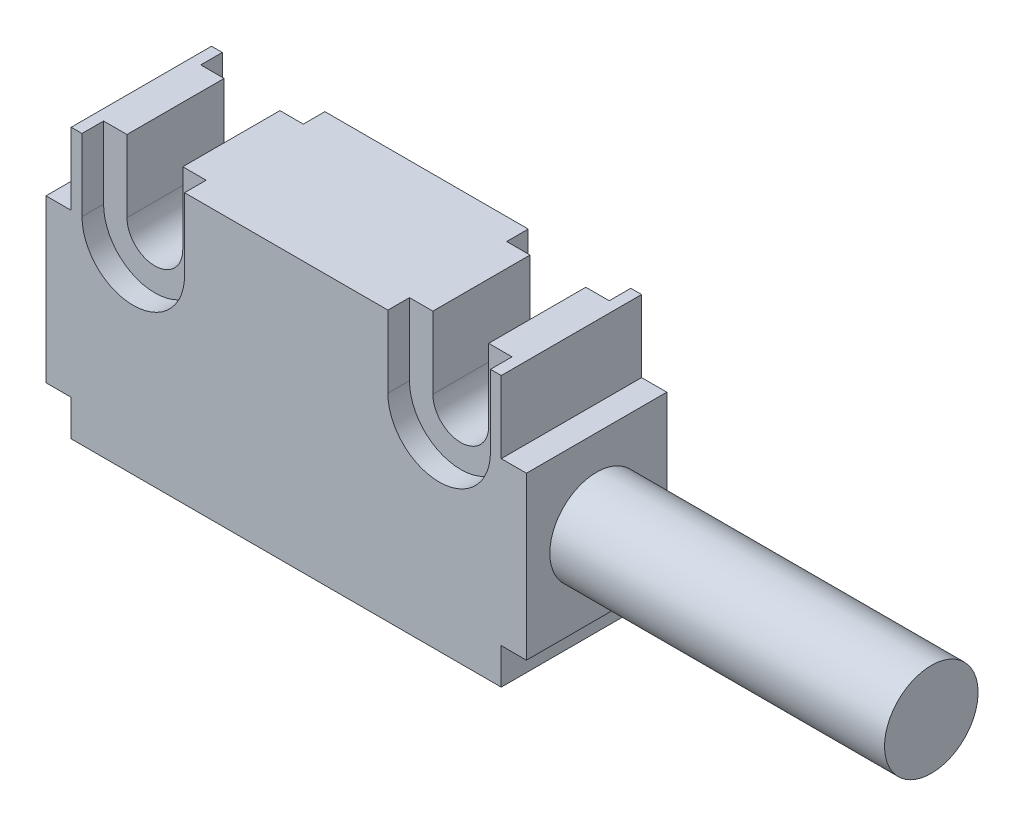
ISO-10303-21;
HEADER;
FILE_DESCRIPTION(('STEP AP214'),'2;1');
FILE_NAME('part.step','',(''),(''),'','','');
FILE_SCHEMA(('AUTOMOTIVE_DESIGN { 1 0 10303 214 1 1 1 1 }'));
ENDSEC;
DATA;
#1=APPLICATION_CONTEXT('core data for automotive mechanical design processes');
#2=APPLICATION_PROTOCOL_DEFINITION('international standard','automotive_design',2000,#1);
#3=PRODUCT_CONTEXT('',#1,'mechanical');
#4=PRODUCT('Part','Part','',(#3));
#5=PRODUCT_RELATED_PRODUCT_CATEGORY('part','',(#4));
#6=PRODUCT_DEFINITION_FORMATION('','',#4);
#7=PRODUCT_DEFINITION_CONTEXT('part definition',#1,'design');
#8=PRODUCT_DEFINITION('design','',#6,#7);
#9=PRODUCT_DEFINITION_SHAPE('','',#8);
#10=(LENGTH_UNIT() NAMED_UNIT(*) SI_UNIT(.MILLI.,.METRE.));
#11=(NAMED_UNIT(*) PLANE_ANGLE_UNIT() SI_UNIT($,.RADIAN.));
#12=(NAMED_UNIT(*) SI_UNIT($,.STERADIAN.) SOLID_ANGLE_UNIT());
#13=UNCERTAINTY_MEASURE_WITH_UNIT(LENGTH_MEASURE(1.E-05),#10,'distance_accuracy_value','');
#14=(GEOMETRIC_REPRESENTATION_CONTEXT(3) GLOBAL_UNCERTAINTY_ASSIGNED_CONTEXT((#13)) GLOBAL_UNIT_ASSIGNED_CONTEXT((#10,
#11,#12)) REPRESENTATION_CONTEXT('',''));
#15=CARTESIAN_POINT('',(0.,0.,0.));
#16=DIRECTION('',(0.,0.,1.));
#17=DIRECTION('',(1.,0.,0.));
#18=AXIS2_PLACEMENT_3D('',#15,#16,#17);
#19=CARTESIAN_POINT('',(8.5,4.5,2.7));
#20=DIRECTION('',(0.,0.,-1.));
#21=DIRECTION('',(-1.,0.,0.));
#22=AXIS2_PLACEMENT_3D('',#19,#20,#21);
#23=PLANE('',#22);
#24=DIRECTION('',(0.,1.,0.));
#25=VECTOR('',#24,1.);
#26=CARTESIAN_POINT('',(11.35,4.5,2.7));
#27=LINE('',#26,#25);
#28=CARTESIAN_POINT('',(11.35,4.5,2.7));
#29=VERTEX_POINT('',#28);
#30=CARTESIAN_POINT('',(11.35,8.5,2.7));
#31=VERTEX_POINT('',#30);
#32=EDGE_CURVE('E279',#29,#31,#27,.T.);
#33=ORIENTED_EDGE('',*,*,#32,.T.);
#34=DIRECTION('',(-1.,0.,0.));
#35=VECTOR('',#34,1.);
#36=CARTESIAN_POINT('',(8.5,8.5,2.7));
#37=LINE('',#36,#35);
#38=CARTESIAN_POINT('',(10.05,8.5,2.7));
#39=VERTEX_POINT('',#38);
#40=EDGE_CURVE('E364',#39,#31,#37,.F.);
#41=ORIENTED_EDGE('',*,*,#40,.F.);
#42=DIRECTION('',(0.,1.,0.));
#43=VECTOR('',#42,1.);
#44=CARTESIAN_POINT('',(10.05,8.5,2.7));
#45=LINE('',#44,#43);
#46=CARTESIAN_POINT('',(10.05,4.5,2.7));
#47=VERTEX_POINT('',#46);
#48=EDGE_CURVE('E248',#39,#47,#45,.F.);
#49=ORIENTED_EDGE('',*,*,#48,.T.);
#50=CARTESIAN_POINT('',(8.5,4.5,2.7));
#51=DIRECTION('',(0.,0.,-1.));
#52=DIRECTION('',(-1.,0.,0.));
#53=AXIS2_PLACEMENT_3D('',#50,#51,#52);
#54=CIRCLE('',#53,1.55);
#55=CARTESIAN_POINT('',(6.95,4.5,2.7));
#56=VERTEX_POINT('',#55);
#57=EDGE_CURVE('E228',#47,#56,#54,.T.);
#58=ORIENTED_EDGE('',*,*,#57,.T.);
#59=DIRECTION('',(0.,-1.,0.));
#60=VECTOR('',#59,1.);
#61=CARTESIAN_POINT('',(6.95,8.5,2.7));
#62=LINE('',#61,#60);
#63=CARTESIAN_POINT('',(6.95,8.5,2.7));
#64=VERTEX_POINT('',#63);
#65=EDGE_CURVE('E208',#56,#64,#62,.F.);
#66=ORIENTED_EDGE('',*,*,#65,.T.);
#67=DIRECTION('',(-1.,0.,0.));
#68=VECTOR('',#67,1.);
#69=CARTESIAN_POINT('',(8.5,8.5,2.7));
#70=LINE('',#69,#68);
#71=CARTESIAN_POINT('',(5.65,8.5,2.7));
#72=VERTEX_POINT('',#71);
#73=EDGE_CURVE('E372',#72,#64,#70,.F.);
#74=ORIENTED_EDGE('',*,*,#73,.F.);
#75=DIRECTION('',(0.,1.,0.));
#76=VECTOR('',#75,1.);
#77=CARTESIAN_POINT('',(5.65,8.5,2.7));
#78=LINE('',#77,#76);
#79=CARTESIAN_POINT('',(5.65,4.5,2.7));
#80=VERTEX_POINT('',#79);
#81=EDGE_CURVE('E329',#72,#80,#78,.F.);
#82=ORIENTED_EDGE('',*,*,#81,.T.);
#83=CARTESIAN_POINT('',(8.5,4.5,2.7));
#84=DIRECTION('',(0.,0.,1.));
#85=DIRECTION('',(1.,0.,0.));
#86=AXIS2_PLACEMENT_3D('',#83,#84,#85);
#87=CIRCLE('',#86,2.85);
#88=EDGE_CURVE('E271',#80,#29,#87,.T.);
#89=ORIENTED_EDGE('',*,*,#88,.T.);
#90=EDGE_LOOP('',(#33,#41,#49,#58,#66,#74,#82,#89));
#91=FACE_BOUND('',#90,.T.);
#92=ADVANCED_FACE('F15',(#91),#23,.F.);
#93=CARTESIAN_POINT('',(-8.5,4.5,2.7));
#94=DIRECTION('',(0.,0.,1.));
#95=DIRECTION('',(1.,0.,0.));
#96=AXIS2_PLACEMENT_3D('',#93,#94,#95);
#97=PLANE('',#96);
#98=CARTESIAN_POINT('',(-8.5,4.5,2.7));
#99=DIRECTION('',(0.,0.,1.));
#100=DIRECTION('',(1.,0.,0.));
#101=AXIS2_PLACEMENT_3D('',#98,#99,#100);
#102=CIRCLE('',#101,2.85);
#103=CARTESIAN_POINT('',(-11.35,4.5,2.7));
#104=VERTEX_POINT('',#103);
#105=CARTESIAN_POINT('',(-5.65,4.5,2.7));
#106=VERTEX_POINT('',#105);
#107=EDGE_CURVE('E312',#104,#106,#102,.T.);
#108=ORIENTED_EDGE('',*,*,#107,.T.);
#109=DIRECTION('',(0.,1.,0.));
#110=VECTOR('',#109,1.);
#111=CARTESIAN_POINT('',(-5.65,8.5,2.7));
#112=LINE('',#111,#110);
#113=CARTESIAN_POINT('',(-5.65,8.5,2.7));
#114=VERTEX_POINT('',#113);
#115=EDGE_CURVE('E316',#106,#114,#112,.T.);
#116=ORIENTED_EDGE('',*,*,#115,.T.);
#117=DIRECTION('',(1.,0.,0.));
#118=VECTOR('',#117,1.);
#119=CARTESIAN_POINT('',(-8.5,8.5,2.7));
#120=LINE('',#119,#118);
#121=CARTESIAN_POINT('',(-6.95,8.5,2.7));
#122=VERTEX_POINT('',#121);
#123=EDGE_CURVE('E201',#114,#122,#120,.F.);
#124=ORIENTED_EDGE('',*,*,#123,.T.);
#125=DIRECTION('',(0.,1.,0.));
#126=VECTOR('',#125,1.);
#127=CARTESIAN_POINT('',(-6.95,8.5,2.7));
#128=LINE('',#127,#126);
#129=CARTESIAN_POINT('',(-6.95,4.5,2.7));
#130=VERTEX_POINT('',#129);
#131=EDGE_CURVE('E192',#122,#130,#128,.F.);
#132=ORIENTED_EDGE('',*,*,#131,.T.);
#133=CARTESIAN_POINT('',(-8.5,4.5,2.7));
#134=DIRECTION('',(0.,0.,-1.));
#135=DIRECTION('',(-1.,0.,0.));
#136=AXIS2_PLACEMENT_3D('',#133,#134,#135);
#137=CIRCLE('',#136,1.55);
#138=CARTESIAN_POINT('',(-10.05,4.5,2.7));
#139=VERTEX_POINT('',#138);
#140=EDGE_CURVE('E18',#130,#139,#137,.T.);
#141=ORIENTED_EDGE('',*,*,#140,.T.);
#142=DIRECTION('',(0.,-1.,0.));
#143=VECTOR('',#142,1.);
#144=CARTESIAN_POINT('',(-10.05,8.5,2.7));
#145=LINE('',#144,#143);
#146=CARTESIAN_POINT('',(-10.05,8.5,2.7));
#147=VERTEX_POINT('',#146);
#148=EDGE_CURVE('E330',#139,#147,#145,.F.);
#149=ORIENTED_EDGE('',*,*,#148,.T.);
#150=DIRECTION('',(1.,0.,0.));
#151=VECTOR('',#150,1.);
#152=CARTESIAN_POINT('',(-8.5,8.5,2.7));
#153=LINE('',#152,#151);
#154=CARTESIAN_POINT('',(-11.35,8.5,2.7));
#155=VERTEX_POINT('',#154);
#156=EDGE_CURVE('E187',#147,#155,#153,.F.);
#157=ORIENTED_EDGE('',*,*,#156,.T.);
#158=DIRECTION('',(0.,-1.,0.));
#159=VECTOR('',#158,1.);
#160=CARTESIAN_POINT('',(-11.35,4.5,2.7));
#161=LINE('',#160,#159);
#162=EDGE_CURVE('E291',#155,#104,#161,.T.);
#163=ORIENTED_EDGE('',*,*,#162,.T.);
#164=EDGE_LOOP('',(#108,#116,#124,#132,#141,#149,#157,#163));
#165=FACE_BOUND('',#164,.T.);
#166=ADVANCED_FACE('F199',(#165),#97,.T.);
#167=CARTESIAN_POINT('',(-8.5,4.5,3.9));
#168=DIRECTION('',(0.,0.,-1.));
#169=DIRECTION('',(-1.,0.,0.));
#170=AXIS2_PLACEMENT_3D('',#167,#168,#169);
#171=CYLINDRICAL_SURFACE('',#170,1.55);
#172=DIRECTION('',(0.,0.,1.));
#173=VECTOR('',#172,1.);
#174=CARTESIAN_POINT('',(-10.05,4.5,3.9));
#175=LINE('',#174,#173);
#176=CARTESIAN_POINT('',(-10.05,4.5,-2.7));
#177=VERTEX_POINT('',#176);
#178=EDGE_CURVE('E181',#177,#139,#175,.T.);
#179=ORIENTED_EDGE('',*,*,#178,.T.);
#180=ORIENTED_EDGE('',*,*,#140,.F.);
#181=DIRECTION('',(0.,0.,1.));
#182=VECTOR('',#181,1.);
#183=CARTESIAN_POINT('',(-6.95,4.5,3.9));
#184=LINE('',#183,#182);
#185=CARTESIAN_POINT('',(-6.95,4.5,-2.7));
#186=VERTEX_POINT('',#185);
#187=EDGE_CURVE('E179',#130,#186,#184,.F.);
#188=ORIENTED_EDGE('',*,*,#187,.T.);
#189=CARTESIAN_POINT('',(-8.5,4.5,-2.7));
#190=DIRECTION('',(0.,0.,-1.));
#191=DIRECTION('',(-1.,0.,0.));
#192=AXIS2_PLACEMENT_3D('',#189,#190,#191);
#193=CIRCLE('',#192,1.55);
#194=EDGE_CURVE('E450',#177,#186,#193,.F.);
#195=ORIENTED_EDGE('',*,*,#194,.F.);
#196=EDGE_LOOP('',(#179,#180,#188,#195));
#197=FACE_BOUND('',#196,.T.);
#198=ADVANCED_FACE('F177',(#197),#171,.F.);
#199=CARTESIAN_POINT('',(-10.05,8.5,3.9));
#200=DIRECTION('',(-1.,0.,0.));
#201=DIRECTION('',(0.,-1.,0.));
#202=AXIS2_PLACEMENT_3D('',#199,#200,#201);
#203=PLANE('',#202);
#204=DIRECTION('',(0.,0.,1.));
#205=VECTOR('',#204,1.);
#206=CARTESIAN_POINT('',(-10.05,8.5,3.9));
#207=LINE('',#206,#205);
#208=CARTESIAN_POINT('',(-10.05,8.5,-2.7));
#209=VERTEX_POINT('',#208);
#210=EDGE_CURVE('E297',#209,#147,#207,.T.);
#211=ORIENTED_EDGE('',*,*,#210,.T.);
#212=ORIENTED_EDGE('',*,*,#148,.F.);
#213=ORIENTED_EDGE('',*,*,#178,.F.);
#214=DIRECTION('',(0.,1.,0.));
#215=VECTOR('',#214,1.);
#216=CARTESIAN_POINT('',(-10.05,4.5,-2.7));
#217=LINE('',#216,#215);
#218=EDGE_CURVE('E196',#209,#177,#217,.F.);
#219=ORIENTED_EDGE('',*,*,#218,.F.);
#220=EDGE_LOOP('',(#211,#212,#213,#219));
#221=FACE_BOUND('',#220,.T.);
#222=ADVANCED_FACE('F1040',(#221),#203,.F.);
#223=CARTESIAN_POINT('',(31.95,0.,0.));
#224=DIRECTION('',(1.,0.,0.));
#225=DIRECTION('',(0.,0.,-1.));
#226=AXIS2_PLACEMENT_3D('',#223,#224,#225);
#227=PLANE('',#226);
#228=CARTESIAN_POINT('',(31.95,0.,0.));
#229=DIRECTION('',(-1.,0.,0.));
#230=DIRECTION('',(0.,0.,1.));
#231=AXIS2_PLACEMENT_3D('',#228,#229,#230);
#232=CIRCLE('',#231,2.6);
#233=CARTESIAN_POINT('',(31.95,0.,2.6));
#234=VERTEX_POINT('',#233);
#235=EDGE_CURVE('E444',#234,#234,#232,.T.);
#236=ORIENTED_EDGE('',*,*,#235,.F.);
#237=EDGE_LOOP('',(#236));
#238=FACE_BOUND('',#237,.T.);
#239=ADVANCED_FACE('F718',(#238),#227,.T.);
#240=CARTESIAN_POINT('',(5.65,8.5,2.7));
#241=DIRECTION('',(-1.,0.,0.));
#242=DIRECTION('',(0.,0.,1.));
#243=AXIS2_PLACEMENT_3D('',#240,#241,#242);
#244=PLANE('',#243);
#245=DIRECTION('',(0.,0.,1.));
#246=VECTOR('',#245,1.);
#247=CARTESIAN_POINT('',(5.65,4.5,2.7));
#248=LINE('',#247,#246);
#249=CARTESIAN_POINT('',(5.65,4.5,3.9));
#250=VERTEX_POINT('',#249);
#251=EDGE_CURVE('E272',#250,#80,#248,.F.);
#252=ORIENTED_EDGE('',*,*,#251,.T.);
#253=ORIENTED_EDGE('',*,*,#81,.F.);
#254=DIRECTION('',(0.,0.,1.));
#255=VECTOR('',#254,1.);
#256=CARTESIAN_POINT('',(5.65,8.5,2.7));
#257=LINE('',#256,#255);
#258=CARTESIAN_POINT('',(5.65,8.5,3.9));
#259=VERTEX_POINT('',#258);
#260=EDGE_CURVE('E325',#259,#72,#257,.F.);
#261=ORIENTED_EDGE('',*,*,#260,.F.);
#262=DIRECTION('',(0.,1.,0.));
#263=VECTOR('',#262,1.);
#264=CARTESIAN_POINT('',(5.65,4.5,3.9));
#265=LINE('',#264,#263);
#266=EDGE_CURVE('E480',#250,#259,#265,.T.);
#267=ORIENTED_EDGE('',*,*,#266,.F.);
#268=EDGE_LOOP('',(#252,#253,#261,#267));
#269=FACE_BOUND('',#268,.T.);
#270=ADVANCED_FACE('F704',(#269),#244,.F.);
#271=CARTESIAN_POINT('',(-5.65,8.5,2.7));
#272=DIRECTION('',(1.,0.,0.));
#273=DIRECTION('',(0.,0.,-1.));
#274=AXIS2_PLACEMENT_3D('',#271,#272,#273);
#275=PLANE('',#274);
#276=DIRECTION('',(0.,0.,-1.));
#277=VECTOR('',#276,1.);
#278=CARTESIAN_POINT('',(-5.65,8.5,2.7));
#279=LINE('',#278,#277);
#280=CARTESIAN_POINT('',(-5.65,8.5,3.9));
#281=VERTEX_POINT('',#280);
#282=EDGE_CURVE('E313',#114,#281,#279,.F.);
#283=ORIENTED_EDGE('',*,*,#282,.F.);
#284=ORIENTED_EDGE('',*,*,#115,.F.);
#285=DIRECTION('',(0.,0.,1.));
#286=VECTOR('',#285,1.);
#287=CARTESIAN_POINT('',(-5.65,4.5,2.7));
#288=LINE('',#287,#286);
#289=CARTESIAN_POINT('',(-5.65,4.5,3.9));
#290=VERTEX_POINT('',#289);
#291=EDGE_CURVE('E308',#106,#290,#288,.T.);
#292=ORIENTED_EDGE('',*,*,#291,.T.);
#293=DIRECTION('',(0.,1.,0.));
#294=VECTOR('',#293,1.);
#295=CARTESIAN_POINT('',(-5.65,4.5,3.9));
#296=LINE('',#295,#294);
#297=EDGE_CURVE('E443',#281,#290,#296,.F.);
#298=ORIENTED_EDGE('',*,*,#297,.F.);
#299=EDGE_LOOP('',(#283,#284,#292,#298));
#300=FACE_BOUND('',#299,.T.);
#301=ADVANCED_FACE('F708',(#300),#275,.F.);
#302=CARTESIAN_POINT('',(-8.5,4.5,2.7));
#303=DIRECTION('',(0.,0.,1.));
#304=DIRECTION('',(1.,0.,0.));
#305=AXIS2_PLACEMENT_3D('',#302,#303,#304);
#306=CYLINDRICAL_SURFACE('',#305,2.85);
#307=ORIENTED_EDGE('',*,*,#291,.F.);
#308=ORIENTED_EDGE('',*,*,#107,.F.);
#309=DIRECTION('',(0.,0.,1.));
#310=VECTOR('',#309,1.);
#311=CARTESIAN_POINT('',(-11.35,4.5,2.7));
#312=LINE('',#311,#310);
#313=CARTESIAN_POINT('',(-11.35,4.5,3.9));
#314=VERTEX_POINT('',#313);
#315=EDGE_CURVE('E287',#104,#314,#312,.T.);
#316=ORIENTED_EDGE('',*,*,#315,.T.);
#317=CARTESIAN_POINT('',(-8.5,4.5,3.9));
#318=DIRECTION('',(0.,0.,1.));
#319=DIRECTION('',(1.,0.,0.));
#320=AXIS2_PLACEMENT_3D('',#317,#318,#319);
#321=CIRCLE('',#320,2.85);
#322=EDGE_CURVE('E440',#290,#314,#321,.F.);
#323=ORIENTED_EDGE('',*,*,#322,.F.);
#324=EDGE_LOOP('',(#307,#308,#316,#323));
#325=FACE_BOUND('',#324,.T.);
#326=ADVANCED_FACE('F463',(#325),#306,.F.);
#327=CARTESIAN_POINT('',(-11.35,4.5,2.7));
#328=DIRECTION('',(-1.,0.,0.));
#329=DIRECTION('',(0.,-1.,0.));
#330=AXIS2_PLACEMENT_3D('',#327,#328,#329);
#331=PLANE('',#330);
#332=ORIENTED_EDGE('',*,*,#315,.F.);
#333=ORIENTED_EDGE('',*,*,#162,.F.);
#334=DIRECTION('',(0.,0.,1.));
#335=VECTOR('',#334,1.);
#336=CARTESIAN_POINT('',(-11.35,8.5,3.9));
#337=LINE('',#336,#335);
#338=CARTESIAN_POINT('',(-11.35,8.5,3.9));
#339=VERTEX_POINT('',#338);
#340=EDGE_CURVE('E292',#155,#339,#337,.T.);
#341=ORIENTED_EDGE('',*,*,#340,.T.);
#342=DIRECTION('',(0.,1.,0.));
#343=VECTOR('',#342,1.);
#344=CARTESIAN_POINT('',(-11.35,4.5,3.9));
#345=LINE('',#344,#343);
#346=EDGE_CURVE('E305',#314,#339,#345,.T.);
#347=ORIENTED_EDGE('',*,*,#346,.F.);
#348=EDGE_LOOP('',(#332,#333,#341,#347));
#349=FACE_BOUND('',#348,.T.);
#350=ADVANCED_FACE('F467',(#349),#331,.F.);
#351=CARTESIAN_POINT('',(11.35,4.5,2.7));
#352=DIRECTION('',(1.,0.,0.));
#353=DIRECTION('',(0.,1.,0.));
#354=AXIS2_PLACEMENT_3D('',#351,#352,#353);
#355=PLANE('',#354);
#356=DIRECTION('',(0.,0.,1.));
#357=VECTOR('',#356,1.);
#358=CARTESIAN_POINT('',(11.35,8.5,2.7));
#359=LINE('',#358,#357);
#360=CARTESIAN_POINT('',(11.35,8.5,3.9));
#361=VERTEX_POINT('',#360);
#362=EDGE_CURVE('E276',#31,#361,#359,.T.);
#363=ORIENTED_EDGE('',*,*,#362,.F.);
#364=ORIENTED_EDGE('',*,*,#32,.F.);
#365=DIRECTION('',(0.,0.,1.));
#366=VECTOR('',#365,1.);
#367=CARTESIAN_POINT('',(11.35,4.5,2.7));
#368=LINE('',#367,#366);
#369=CARTESIAN_POINT('',(11.35,4.5,3.9));
#370=VERTEX_POINT('',#369);
#371=EDGE_CURVE('E252',#29,#370,#368,.T.);
#372=ORIENTED_EDGE('',*,*,#371,.T.);
#373=DIRECTION('',(0.,1.,0.));
#374=VECTOR('',#373,1.);
#375=CARTESIAN_POINT('',(11.35,4.5,3.9));
#376=LINE('',#375,#374);
#377=EDGE_CURVE('E439',#361,#370,#376,.F.);
#378=ORIENTED_EDGE('',*,*,#377,.F.);
#379=EDGE_LOOP('',(#363,#364,#372,#378));
#380=FACE_BOUND('',#379,.T.);
#381=ADVANCED_FACE('F695',(#380),#355,.F.);
#382=CARTESIAN_POINT('',(8.5,4.5,2.7));
#383=DIRECTION('',(0.,0.,1.));
#384=DIRECTION('',(1.,0.,0.));
#385=AXIS2_PLACEMENT_3D('',#382,#383,#384);
#386=CYLINDRICAL_SURFACE('',#385,2.85);
#387=ORIENTED_EDGE('',*,*,#371,.F.);
#388=ORIENTED_EDGE('',*,*,#88,.F.);
#389=ORIENTED_EDGE('',*,*,#251,.F.);
#390=CARTESIAN_POINT('',(8.5,4.5,3.9));
#391=DIRECTION('',(0.,0.,1.));
#392=DIRECTION('',(1.,0.,0.));
#393=AXIS2_PLACEMENT_3D('',#390,#391,#392);
#394=CIRCLE('',#393,2.85);
#395=EDGE_CURVE('E245',#370,#250,#394,.F.);
#396=ORIENTED_EDGE('',*,*,#395,.F.);
#397=EDGE_LOOP('',(#387,#388,#389,#396));
#398=FACE_BOUND('',#397,.T.);
#399=ADVANCED_FACE('F700',(#398),#386,.F.);
#400=CARTESIAN_POINT('',(10.05,8.5,3.9));
#401=DIRECTION('',(1.,0.,0.));
#402=DIRECTION('',(0.,1.,0.));
#403=AXIS2_PLACEMENT_3D('',#400,#401,#402);
#404=PLANE('',#403);
#405=DIRECTION('',(0.,1.,0.));
#406=VECTOR('',#405,1.);
#407=CARTESIAN_POINT('',(10.05,4.5,-2.7));
#408=LINE('',#407,#406);
#409=CARTESIAN_POINT('',(10.05,8.5,-2.7));
#410=VERTEX_POINT('',#409);
#411=CARTESIAN_POINT('',(10.05,4.5,-2.7));
#412=VERTEX_POINT('',#411);
#413=EDGE_CURVE('E435',#410,#412,#408,.F.);
#414=ORIENTED_EDGE('',*,*,#413,.T.);
#415=DIRECTION('',(0.,0.,-1.));
#416=VECTOR('',#415,1.);
#417=CARTESIAN_POINT('',(10.05,4.5,3.9));
#418=LINE('',#417,#416);
#419=EDGE_CURVE('E224',#412,#47,#418,.F.);
#420=ORIENTED_EDGE('',*,*,#419,.T.);
#421=ORIENTED_EDGE('',*,*,#48,.F.);
#422=DIRECTION('',(0.,0.,1.));
#423=VECTOR('',#422,1.);
#424=CARTESIAN_POINT('',(10.05,8.5,3.9));
#425=LINE('',#424,#423);
#426=EDGE_CURVE('E234',#39,#410,#425,.F.);
#427=ORIENTED_EDGE('',*,*,#426,.T.);
#428=EDGE_LOOP('',(#414,#420,#421,#427));
#429=FACE_BOUND('',#428,.T.);
#430=ADVANCED_FACE('F688',(#429),#404,.F.);
#431=CARTESIAN_POINT('',(8.5,4.5,3.9));
#432=DIRECTION('',(0.,0.,-1.));
#433=DIRECTION('',(-1.,0.,0.));
#434=AXIS2_PLACEMENT_3D('',#431,#432,#433);
#435=CYLINDRICAL_SURFACE('',#434,1.55);
#436=CARTESIAN_POINT('',(8.5,4.5,-2.7));
#437=DIRECTION('',(0.,0.,-1.));
#438=DIRECTION('',(-1.,0.,0.));
#439=AXIS2_PLACEMENT_3D('',#436,#437,#438);
#440=CIRCLE('',#439,1.55);
#441=CARTESIAN_POINT('',(6.95,4.5,-2.7));
#442=VERTEX_POINT('',#441);
#443=EDGE_CURVE('E431',#412,#442,#440,.T.);
#444=ORIENTED_EDGE('',*,*,#443,.T.);
#445=DIRECTION('',(0.,0.,1.));
#446=VECTOR('',#445,1.);
#447=CARTESIAN_POINT('',(6.95,4.5,3.9));
#448=LINE('',#447,#446);
#449=EDGE_CURVE('E203',#442,#56,#448,.T.);
#450=ORIENTED_EDGE('',*,*,#449,.T.);
#451=ORIENTED_EDGE('',*,*,#57,.F.);
#452=ORIENTED_EDGE('',*,*,#419,.F.);
#453=EDGE_LOOP('',(#444,#450,#451,#452));
#454=FACE_BOUND('',#453,.T.);
#455=ADVANCED_FACE('F811',(#454),#435,.F.);
#456=CARTESIAN_POINT('',(6.95,8.5,3.9));
#457=DIRECTION('',(-1.,0.,0.));
#458=DIRECTION('',(0.,-1.,0.));
#459=AXIS2_PLACEMENT_3D('',#456,#457,#458);
#460=PLANE('',#459);
#461=DIRECTION('',(0.,1.,0.));
#462=VECTOR('',#461,1.);
#463=CARTESIAN_POINT('',(6.95,4.5,-2.7));
#464=LINE('',#463,#462);
#465=CARTESIAN_POINT('',(6.95,8.5,-2.7));
#466=VERTEX_POINT('',#465);
#467=EDGE_CURVE('E430',#442,#466,#464,.T.);
#468=ORIENTED_EDGE('',*,*,#467,.T.);
#469=DIRECTION('',(0.,0.,-1.));
#470=VECTOR('',#469,1.);
#471=CARTESIAN_POINT('',(6.95,8.5,3.9));
#472=LINE('',#471,#470);
#473=EDGE_CURVE('E216',#466,#64,#472,.F.);
#474=ORIENTED_EDGE('',*,*,#473,.T.);
#475=ORIENTED_EDGE('',*,*,#65,.F.);
#476=ORIENTED_EDGE('',*,*,#449,.F.);
#477=EDGE_LOOP('',(#468,#474,#475,#476));
#478=FACE_BOUND('',#477,.T.);
#479=ADVANCED_FACE('F808',(#478),#460,.F.);
#480=CARTESIAN_POINT('',(-6.95,8.5,3.9));
#481=DIRECTION('',(1.,0.,0.));
#482=DIRECTION('',(0.,1.,0.));
#483=AXIS2_PLACEMENT_3D('',#480,#481,#482);
#484=PLANE('',#483);
#485=ORIENTED_EDGE('',*,*,#187,.F.);
#486=ORIENTED_EDGE('',*,*,#131,.F.);
#487=DIRECTION('',(0.,0.,-1.));
#488=VECTOR('',#487,1.);
#489=CARTESIAN_POINT('',(-6.95,8.5,3.9));
#490=LINE('',#489,#488);
#491=CARTESIAN_POINT('',(-6.95,8.5,-2.7));
#492=VERTEX_POINT('',#491);
#493=EDGE_CURVE('E322',#122,#492,#490,.T.);
#494=ORIENTED_EDGE('',*,*,#493,.T.);
#495=DIRECTION('',(0.,1.,0.));
#496=VECTOR('',#495,1.);
#497=CARTESIAN_POINT('',(-6.95,4.5,-2.7));
#498=LINE('',#497,#496);
#499=EDGE_CURVE('E194',#186,#492,#498,.T.);
#500=ORIENTED_EDGE('',*,*,#499,.F.);
#501=EDGE_LOOP('',(#485,#486,#494,#500));
#502=FACE_BOUND('',#501,.T.);
#503=ADVANCED_FACE('F190',(#502),#484,.F.);
#504=CARTESIAN_POINT('',(-8.5,4.5,-2.7));
#505=DIRECTION('',(0.,0.,-1.));
#506=DIRECTION('',(-1.,0.,0.));
#507=AXIS2_PLACEMENT_3D('',#504,#505,#506);
#508=PLANE('',#507);
#509=ORIENTED_EDGE('',*,*,#194,.T.);
#510=ORIENTED_EDGE('',*,*,#499,.T.);
#511=DIRECTION('',(1.,0.,0.));
#512=VECTOR('',#511,1.);
#513=CARTESIAN_POINT('',(6.95,8.5,-2.7));
#514=LINE('',#513,#512);
#515=CARTESIAN_POINT('',(-5.65,8.5,-2.7));
#516=VERTEX_POINT('',#515);
#517=EDGE_CURVE('E533',#492,#516,#514,.T.);
#518=ORIENTED_EDGE('',*,*,#517,.T.);
#519=DIRECTION('',(0.,1.,0.));
#520=VECTOR('',#519,1.);
#521=CARTESIAN_POINT('',(-5.65,8.5,-2.7));
#522=LINE('',#521,#520);
#523=CARTESIAN_POINT('',(-5.65,4.5,-2.7));
#524=VERTEX_POINT('',#523);
#525=EDGE_CURVE('E525',#524,#516,#522,.T.);
#526=ORIENTED_EDGE('',*,*,#525,.F.);
#527=CARTESIAN_POINT('',(-8.5,4.5,-2.7));
#528=DIRECTION('',(0.,0.,-1.));
#529=DIRECTION('',(-1.,0.,0.));
#530=AXIS2_PLACEMENT_3D('',#527,#528,#529);
#531=CIRCLE('',#530,2.85);
#532=CARTESIAN_POINT('',(-11.35,4.5,-2.7));
#533=VERTEX_POINT('',#532);
#534=EDGE_CURVE('E419',#524,#533,#531,.T.);
#535=ORIENTED_EDGE('',*,*,#534,.T.);
#536=DIRECTION('',(0.,1.,0.));
#537=VECTOR('',#536,1.);
#538=CARTESIAN_POINT('',(-11.35,4.5,-2.7));
#539=LINE('',#538,#537);
#540=CARTESIAN_POINT('',(-11.35,8.5,-2.7));
#541=VERTEX_POINT('',#540);
#542=EDGE_CURVE('E502',#541,#533,#539,.F.);
#543=ORIENTED_EDGE('',*,*,#542,.F.);
#544=DIRECTION('',(1.,0.,0.));
#545=VECTOR('',#544,1.);
#546=CARTESIAN_POINT('',(-10.05,8.5,-2.7));
#547=LINE('',#546,#545);
#548=EDGE_CURVE('E357',#541,#209,#547,.T.);
#549=ORIENTED_EDGE('',*,*,#548,.T.);
#550=ORIENTED_EDGE('',*,*,#218,.T.);
#551=EDGE_LOOP('',(#509,#510,#518,#526,#535,#543,#549,#550));
#552=FACE_BOUND('',#551,.T.);
#553=ADVANCED_FACE('F557',(#552),#508,.T.);
#554=CARTESIAN_POINT('',(-10.05,8.5,3.9));
#555=DIRECTION('',(0.,-1.,0.));
#556=DIRECTION('',(1.,0.,0.));
#557=AXIS2_PLACEMENT_3D('',#554,#555,#556);
#558=PLANE('',#557);
#559=DIRECTION('',(1.,0.,0.));
#560=VECTOR('',#559,1.);
#561=CARTESIAN_POINT('',(-10.05,8.5,-3.9));
#562=LINE('',#561,#560);
#563=CARTESIAN_POINT('',(-11.95,8.5,-3.9));
#564=VERTEX_POINT('',#563);
#565=CARTESIAN_POINT('',(-11.35,8.5,-3.9));
#566=VERTEX_POINT('',#565);
#567=EDGE_CURVE('E296',#564,#566,#562,.T.);
#568=ORIENTED_EDGE('',*,*,#567,.F.);
#569=DIRECTION('',(0.,0.,-1.));
#570=VECTOR('',#569,1.);
#571=CARTESIAN_POINT('',(-11.95,8.5,3.9));
#572=LINE('',#571,#570);
#573=CARTESIAN_POINT('',(-11.95,8.5,3.9));
#574=VERTEX_POINT('',#573);
#575=EDGE_CURVE('E333',#564,#574,#572,.F.);
#576=ORIENTED_EDGE('',*,*,#575,.T.);
#577=DIRECTION('',(1.,0.,0.));
#578=VECTOR('',#577,1.);
#579=CARTESIAN_POINT('',(8.5,8.5,3.9));
#580=LINE('',#579,#578);
#581=EDGE_CURVE('E300',#339,#574,#580,.F.);
#582=ORIENTED_EDGE('',*,*,#581,.F.);
#583=ORIENTED_EDGE('',*,*,#340,.F.);
#584=ORIENTED_EDGE('',*,*,#156,.F.);
#585=ORIENTED_EDGE('',*,*,#210,.F.);
#586=ORIENTED_EDGE('',*,*,#548,.F.);
#587=DIRECTION('',(0.,0.,1.));
#588=VECTOR('',#587,1.);
#589=CARTESIAN_POINT('',(-11.35,8.5,-2.7));
#590=LINE('',#589,#588);
#591=EDGE_CURVE('E423',#566,#541,#590,.T.);
#592=ORIENTED_EDGE('',*,*,#591,.F.);
#593=EDGE_LOOP('',(#568,#576,#582,#583,#584,#585,#586,#592));
#594=FACE_BOUND('',#593,.T.);
#595=ADVANCED_FACE('F800',(#594),#558,.F.);
#596=CARTESIAN_POINT('',(-13.35,4.5,3.9));
#597=DIRECTION('',(0.,-1.,0.));
#598=DIRECTION('',(1.,0.,0.));
#599=AXIS2_PLACEMENT_3D('',#596,#597,#598);
#600=PLANE('',#599);
#601=DIRECTION('',(0.,0.,-1.));
#602=VECTOR('',#601,1.);
#603=CARTESIAN_POINT('',(-13.35,4.5,3.9));
#604=LINE('',#603,#602);
#605=CARTESIAN_POINT('',(-13.35,4.5,-3.9));
#606=VERTEX_POINT('',#605);
#607=CARTESIAN_POINT('',(-13.35,4.5,3.9));
#608=VERTEX_POINT('',#607);
#609=EDGE_CURVE('E641',#606,#608,#604,.F.);
#610=ORIENTED_EDGE('',*,*,#609,.T.);
#611=DIRECTION('',(1.,0.,0.));
#612=VECTOR('',#611,1.);
#613=CARTESIAN_POINT('',(8.5,4.5,3.9));
#614=LINE('',#613,#612);
#615=CARTESIAN_POINT('',(-11.95,4.5,3.9));
#616=VERTEX_POINT('',#615);
#617=EDGE_CURVE('E304',#616,#608,#614,.F.);
#618=ORIENTED_EDGE('',*,*,#617,.F.);
#619=DIRECTION('',(0.,0.,-1.));
#620=VECTOR('',#619,1.);
#621=CARTESIAN_POINT('',(-11.95,4.5,3.9));
#622=LINE('',#621,#620);
#623=CARTESIAN_POINT('',(-11.95,4.5,-3.9));
#624=VERTEX_POINT('',#623);
#625=EDGE_CURVE('E650',#616,#624,#622,.T.);
#626=ORIENTED_EDGE('',*,*,#625,.T.);
#627=DIRECTION('',(1.,0.,0.));
#628=VECTOR('',#627,1.);
#629=CARTESIAN_POINT('',(-13.35,4.5,-3.9));
#630=LINE('',#629,#628);
#631=EDGE_CURVE('E498',#606,#624,#630,.T.);
#632=ORIENTED_EDGE('',*,*,#631,.F.);
#633=EDGE_LOOP('',(#610,#618,#626,#632));
#634=FACE_BOUND('',#633,.T.);
#635=ADVANCED_FACE('F648',(#634),#600,.F.);
#636=CARTESIAN_POINT('',(-11.95,-4.5,3.9));
#637=DIRECTION('',(0.,1.,0.));
#638=DIRECTION('',(0.,0.,1.));
#639=AXIS2_PLACEMENT_3D('',#636,#637,#638);
#640=PLANE('',#639);
#641=DIRECTION('',(0.,0.,-1.));
#642=VECTOR('',#641,1.);
#643=CARTESIAN_POINT('',(-11.95,-4.5,3.9));
#644=LINE('',#643,#642);
#645=CARTESIAN_POINT('',(-11.95,-4.5,-3.9));
#646=VERTEX_POINT('',#645);
#647=CARTESIAN_POINT('',(-11.95,-4.5,3.9));
#648=VERTEX_POINT('',#647);
#649=EDGE_CURVE('E1144',#646,#648,#644,.F.);
#650=ORIENTED_EDGE('',*,*,#649,.T.);
#651=DIRECTION('',(1.,0.,0.));
#652=VECTOR('',#651,1.);
#653=CARTESIAN_POINT('',(8.5,-4.5,3.9));
#654=LINE('',#653,#652);
#655=CARTESIAN_POINT('',(-13.35,-4.5,3.9));
#656=VERTEX_POINT('',#655);
#657=EDGE_CURVE('E611',#656,#648,#654,.T.);
#658=ORIENTED_EDGE('',*,*,#657,.F.);
#659=DIRECTION('',(0.,0.,-1.));
#660=VECTOR('',#659,1.);
#661=CARTESIAN_POINT('',(-13.35,-4.5,3.9));
#662=LINE('',#661,#660);
#663=CARTESIAN_POINT('',(-13.35,-4.5,-3.9));
#664=VERTEX_POINT('',#663);
#665=EDGE_CURVE('E644',#656,#664,#662,.T.);
#666=ORIENTED_EDGE('',*,*,#665,.T.);
#667=DIRECTION('',(1.,0.,0.));
#668=VECTOR('',#667,1.);
#669=CARTESIAN_POINT('',(-11.95,-4.5,-3.9));
#670=LINE('',#669,#668);
#671=EDGE_CURVE('E494',#646,#664,#670,.F.);
#672=ORIENTED_EDGE('',*,*,#671,.F.);
#673=EDGE_LOOP('',(#650,#658,#666,#672));
#674=FACE_BOUND('',#673,.T.);
#675=ADVANCED_FACE('F793',(#674),#640,.F.);
#676=CARTESIAN_POINT('',(11.95,-4.5,3.9));
#677=DIRECTION('',(0.,1.,0.));
#678=DIRECTION('',(0.,0.,1.));
#679=AXIS2_PLACEMENT_3D('',#676,#677,#678);
#680=PLANE('',#679);
#681=DIRECTION('',(0.,0.,1.));
#682=VECTOR('',#681,1.);
#683=CARTESIAN_POINT('',(13.35,-4.5,3.9));
#684=LINE('',#683,#682);
#685=CARTESIAN_POINT('',(13.35,-4.5,-3.9));
#686=VERTEX_POINT('',#685);
#687=CARTESIAN_POINT('',(13.35,-4.5,3.9));
#688=VERTEX_POINT('',#687);
#689=EDGE_CURVE('E1117',#686,#688,#684,.T.);
#690=ORIENTED_EDGE('',*,*,#689,.T.);
#691=DIRECTION('',(1.,0.,0.));
#692=VECTOR('',#691,1.);
#693=CARTESIAN_POINT('',(8.5,-4.5,3.9));
#694=LINE('',#693,#692);
#695=CARTESIAN_POINT('',(11.95,-4.5,3.9));
#696=VERTEX_POINT('',#695);
#697=EDGE_CURVE('E608',#696,#688,#694,.T.);
#698=ORIENTED_EDGE('',*,*,#697,.F.);
#699=DIRECTION('',(0.,0.,1.));
#700=VECTOR('',#699,1.);
#701=CARTESIAN_POINT('',(11.95,-4.5,3.9));
#702=LINE('',#701,#700);
#703=CARTESIAN_POINT('',(11.95,-4.5,-3.9));
#704=VERTEX_POINT('',#703);
#705=EDGE_CURVE('E1121',#696,#704,#702,.F.);
#706=ORIENTED_EDGE('',*,*,#705,.T.);
#707=DIRECTION('',(1.,0.,0.));
#708=VECTOR('',#707,1.);
#709=CARTESIAN_POINT('',(11.95,-4.5,-3.9));
#710=LINE('',#709,#708);
#711=EDGE_CURVE('E449',#686,#704,#710,.F.);
#712=ORIENTED_EDGE('',*,*,#711,.F.);
#713=EDGE_LOOP('',(#690,#698,#706,#712));
#714=FACE_BOUND('',#713,.T.);
#715=ADVANCED_FACE('F789',(#714),#680,.F.);
#716=CARTESIAN_POINT('',(31.95,0.,0.));
#717=DIRECTION('',(-1.,0.,0.));
#718=DIRECTION('',(0.,0.,1.));
#719=AXIS2_PLACEMENT_3D('',#716,#717,#718);
#720=CYLINDRICAL_SURFACE('',#719,2.6);
#721=ORIENTED_EDGE('',*,*,#235,.T.);
#722=EDGE_LOOP('',(#721));
#723=FACE_BOUND('',#722,.T.);
#724=CARTESIAN_POINT('',(13.35,0.,0.));
#725=DIRECTION('',(-1.,0.,0.));
#726=DIRECTION('',(0.,0.,1.));
#727=AXIS2_PLACEMENT_3D('',#724,#725,#726);
#728=CIRCLE('',#727,2.6);
#729=CARTESIAN_POINT('',(13.35,0.,2.6));
#730=VERTEX_POINT('',#729);
#731=EDGE_CURVE('E413',#730,#730,#728,.F.);
#732=ORIENTED_EDGE('',*,*,#731,.T.);
#733=EDGE_LOOP('',(#732));
#734=FACE_BOUND('',#733,.T.);
#735=ADVANCED_FACE('F785',(#723,#734),#720,.T.);
#736=CARTESIAN_POINT('',(13.35,4.5,3.9));
#737=DIRECTION('',(0.,-1.,0.));
#738=DIRECTION('',(1.,0.,0.));
#739=AXIS2_PLACEMENT_3D('',#736,#737,#738);
#740=PLANE('',#739);
#741=DIRECTION('',(0.,0.,1.));
#742=VECTOR('',#741,1.);
#743=CARTESIAN_POINT('',(11.95,4.5,3.9));
#744=LINE('',#743,#742);
#745=CARTESIAN_POINT('',(11.95,4.5,-3.9));
#746=VERTEX_POINT('',#745);
#747=CARTESIAN_POINT('',(11.95,4.5,3.9));
#748=VERTEX_POINT('',#747);
#749=EDGE_CURVE('E417',#746,#748,#744,.T.);
#750=ORIENTED_EDGE('',*,*,#749,.T.);
#751=DIRECTION('',(1.,0.,0.));
#752=VECTOR('',#751,1.);
#753=CARTESIAN_POINT('',(8.5,4.5,3.9));
#754=LINE('',#753,#752);
#755=CARTESIAN_POINT('',(13.35,4.5,3.9));
#756=VERTEX_POINT('',#755);
#757=EDGE_CURVE('E602',#756,#748,#754,.F.);
#758=ORIENTED_EDGE('',*,*,#757,.F.);
#759=DIRECTION('',(0.,0.,1.));
#760=VECTOR('',#759,1.);
#761=CARTESIAN_POINT('',(13.35,4.5,3.9));
#762=LINE('',#761,#760);
#763=CARTESIAN_POINT('',(13.35,4.5,-3.9));
#764=VERTEX_POINT('',#763);
#765=EDGE_CURVE('E418',#756,#764,#762,.F.);
#766=ORIENTED_EDGE('',*,*,#765,.T.);
#767=DIRECTION('',(1.,0.,0.));
#768=VECTOR('',#767,1.);
#769=CARTESIAN_POINT('',(13.35,4.5,-3.9));
#770=LINE('',#769,#768);
#771=EDGE_CURVE('E448',#746,#764,#770,.T.);
#772=ORIENTED_EDGE('',*,*,#771,.F.);
#773=EDGE_LOOP('',(#750,#758,#766,#772));
#774=FACE_BOUND('',#773,.T.);
#775=ADVANCED_FACE('F782',(#774),#740,.F.);
#776=CARTESIAN_POINT('',(8.5,4.5,3.9));
#777=DIRECTION('',(0.,0.,1.));
#778=DIRECTION('',(1.,0.,0.));
#779=AXIS2_PLACEMENT_3D('',#776,#777,#778);
#780=PLANE('',#779);
#781=ORIENTED_EDGE('',*,*,#377,.T.);
#782=ORIENTED_EDGE('',*,*,#395,.T.);
#783=ORIENTED_EDGE('',*,*,#266,.T.);
#784=DIRECTION('',(1.,0.,0.));
#785=VECTOR('',#784,1.);
#786=CARTESIAN_POINT('',(6.95,8.5,3.9));
#787=LINE('',#786,#785);
#788=EDGE_CURVE('E220',#259,#281,#787,.F.);
#789=ORIENTED_EDGE('',*,*,#788,.T.);
#790=ORIENTED_EDGE('',*,*,#297,.T.);
#791=ORIENTED_EDGE('',*,*,#322,.T.);
#792=ORIENTED_EDGE('',*,*,#346,.T.);
#793=ORIENTED_EDGE('',*,*,#581,.T.);
#794=DIRECTION('',(0.,1.,0.));
#795=VECTOR('',#794,1.);
#796=CARTESIAN_POINT('',(-11.95,4.5,3.9));
#797=LINE('',#796,#795);
#798=EDGE_CURVE('E337',#574,#616,#797,.F.);
#799=ORIENTED_EDGE('',*,*,#798,.T.);
#800=ORIENTED_EDGE('',*,*,#617,.T.);
#801=DIRECTION('',(0.,1.,0.));
#802=VECTOR('',#801,1.);
#803=CARTESIAN_POINT('',(-13.35,-4.5,3.9));
#804=LINE('',#803,#802);
#805=EDGE_CURVE('E627',#608,#656,#804,.F.);
#806=ORIENTED_EDGE('',*,*,#805,.T.);
#807=ORIENTED_EDGE('',*,*,#657,.T.);
#808=DIRECTION('',(0.,1.,0.));
#809=VECTOR('',#808,1.);
#810=CARTESIAN_POINT('',(-11.95,-6.5,3.9));
#811=LINE('',#810,#809);
#812=CARTESIAN_POINT('',(-11.95,-6.5,3.9));
#813=VERTEX_POINT('',#812);
#814=EDGE_CURVE('E1141',#648,#813,#811,.F.);
#815=ORIENTED_EDGE('',*,*,#814,.T.);
#816=DIRECTION('',(1.,0.,0.));
#817=VECTOR('',#816,1.);
#818=CARTESIAN_POINT('',(-11.95,-6.5,3.9));
#819=LINE('',#818,#817);
#820=CARTESIAN_POINT('',(11.95,-6.5,3.9));
#821=VERTEX_POINT('',#820);
#822=EDGE_CURVE('E1133',#813,#821,#819,.T.);
#823=ORIENTED_EDGE('',*,*,#822,.T.);
#824=DIRECTION('',(0.,1.,0.));
#825=VECTOR('',#824,1.);
#826=CARTESIAN_POINT('',(11.95,-6.5,3.9));
#827=LINE('',#826,#825);
#828=EDGE_CURVE('E1125',#821,#696,#827,.T.);
#829=ORIENTED_EDGE('',*,*,#828,.T.);
#830=ORIENTED_EDGE('',*,*,#697,.T.);
#831=DIRECTION('',(0.,1.,0.));
#832=VECTOR('',#831,1.);
#833=CARTESIAN_POINT('',(13.35,-4.5,3.9));
#834=LINE('',#833,#832);
#835=EDGE_CURVE('E1113',#688,#756,#834,.T.);
#836=ORIENTED_EDGE('',*,*,#835,.T.);
#837=ORIENTED_EDGE('',*,*,#757,.T.);
#838=DIRECTION('',(0.,1.,0.));
#839=VECTOR('',#838,1.);
#840=CARTESIAN_POINT('',(11.95,4.5,3.9));
#841=LINE('',#840,#839);
#842=CARTESIAN_POINT('',(11.95,8.5,3.9));
#843=VERTEX_POINT('',#842);
#844=EDGE_CURVE('E259',#748,#843,#841,.T.);
#845=ORIENTED_EDGE('',*,*,#844,.T.);
#846=DIRECTION('',(1.,0.,0.));
#847=VECTOR('',#846,1.);
#848=CARTESIAN_POINT('',(11.95,8.5,3.9));
#849=LINE('',#848,#847);
#850=EDGE_CURVE('E240',#843,#361,#849,.F.);
#851=ORIENTED_EDGE('',*,*,#850,.T.);
#852=EDGE_LOOP('',(#781,#782,#783,#789,#790,#791,#792,#793,#799,#800,#806,#807,#815,#823,#829,
#830,#836,#837,#845,#851));
#853=FACE_BOUND('',#852,.T.);
#854=ADVANCED_FACE('F625',(#853),#780,.T.);
#855=CARTESIAN_POINT('',(11.95,8.5,3.9));
#856=DIRECTION('',(0.,-1.,0.));
#857=DIRECTION('',(1.,0.,0.));
#858=AXIS2_PLACEMENT_3D('',#855,#856,#857);
#859=PLANE('',#858);
#860=DIRECTION('',(1.,0.,0.));
#861=VECTOR('',#860,1.);
#862=CARTESIAN_POINT('',(8.5,8.5,-2.7));
#863=LINE('',#862,#861);
#864=CARTESIAN_POINT('',(11.35,8.5,-2.7));
#865=VERTEX_POINT('',#864);
#866=EDGE_CURVE('E233',#865,#410,#863,.F.);
#867=ORIENTED_EDGE('',*,*,#866,.T.);
#868=ORIENTED_EDGE('',*,*,#426,.F.);
#869=ORIENTED_EDGE('',*,*,#40,.T.);
#870=ORIENTED_EDGE('',*,*,#362,.T.);
#871=ORIENTED_EDGE('',*,*,#850,.F.);
#872=DIRECTION('',(0.,0.,1.));
#873=VECTOR('',#872,1.);
#874=CARTESIAN_POINT('',(11.95,8.5,3.9));
#875=LINE('',#874,#873);
#876=CARTESIAN_POINT('',(11.95,8.5,-3.9));
#877=VERTEX_POINT('',#876);
#878=EDGE_CURVE('E255',#843,#877,#875,.F.);
#879=ORIENTED_EDGE('',*,*,#878,.T.);
#880=DIRECTION('',(1.,0.,0.));
#881=VECTOR('',#880,1.);
#882=CARTESIAN_POINT('',(11.95,8.5,-3.9));
#883=LINE('',#882,#881);
#884=CARTESIAN_POINT('',(11.35,8.5,-3.9));
#885=VERTEX_POINT('',#884);
#886=EDGE_CURVE('E34',#885,#877,#883,.T.);
#887=ORIENTED_EDGE('',*,*,#886,.F.);
#888=DIRECTION('',(0.,0.,1.));
#889=VECTOR('',#888,1.);
#890=CARTESIAN_POINT('',(11.35,8.5,3.9));
#891=LINE('',#890,#889);
#892=EDGE_CURVE('E229',#865,#885,#891,.F.);
#893=ORIENTED_EDGE('',*,*,#892,.F.);
#894=EDGE_LOOP('',(#867,#868,#869,#870,#871,#879,#887,#893));
#895=FACE_BOUND('',#894,.T.);
#896=ADVANCED_FACE('F572',(#895),#859,.F.);
#897=CARTESIAN_POINT('',(8.5,4.5,-2.7));
#898=DIRECTION('',(0.,0.,1.));
#899=DIRECTION('',(1.,0.,0.));
#900=AXIS2_PLACEMENT_3D('',#897,#898,#899);
#901=PLANE('',#900);
#902=DIRECTION('',(0.,1.,0.));
#903=VECTOR('',#902,1.);
#904=CARTESIAN_POINT('',(5.65,8.5,-2.7));
#905=LINE('',#904,#903);
#906=CARTESIAN_POINT('',(5.65,8.5,-2.7));
#907=VERTEX_POINT('',#906);
#908=CARTESIAN_POINT('',(5.65,4.5,-2.7));
#909=VERTEX_POINT('',#908);
#910=EDGE_CURVE('E429',#907,#909,#905,.F.);
#911=ORIENTED_EDGE('',*,*,#910,.F.);
#912=DIRECTION('',(1.,0.,0.));
#913=VECTOR('',#912,1.);
#914=CARTESIAN_POINT('',(6.95,8.5,-2.7));
#915=LINE('',#914,#913);
#916=EDGE_CURVE('E221',#907,#466,#915,.T.);
#917=ORIENTED_EDGE('',*,*,#916,.T.);
#918=ORIENTED_EDGE('',*,*,#467,.F.);
#919=ORIENTED_EDGE('',*,*,#443,.F.);
#920=ORIENTED_EDGE('',*,*,#413,.F.);
#921=ORIENTED_EDGE('',*,*,#866,.F.);
#922=DIRECTION('',(0.,-1.,0.));
#923=VECTOR('',#922,1.);
#924=CARTESIAN_POINT('',(11.35,4.5,-2.7));
#925=LINE('',#924,#923);
#926=CARTESIAN_POINT('',(11.35,4.5,-2.7));
#927=VERTEX_POINT('',#926);
#928=EDGE_CURVE('E412',#927,#865,#925,.F.);
#929=ORIENTED_EDGE('',*,*,#928,.F.);
#930=CARTESIAN_POINT('',(8.5,4.5,-2.7));
#931=DIRECTION('',(0.,0.,-1.));
#932=DIRECTION('',(-1.,0.,0.));
#933=AXIS2_PLACEMENT_3D('',#930,#931,#932);
#934=CIRCLE('',#933,2.85);
#935=EDGE_CURVE('E425',#927,#909,#934,.T.);
#936=ORIENTED_EDGE('',*,*,#935,.T.);
#937=EDGE_LOOP('',(#911,#917,#918,#919,#920,#921,#929,#936));
#938=FACE_BOUND('',#937,.T.);
#939=ADVANCED_FACE('F580',(#938),#901,.F.);
#940=CARTESIAN_POINT('',(8.5,4.5,-2.7));
#941=DIRECTION('',(0.,0.,-1.));
#942=DIRECTION('',(-1.,0.,0.));
#943=AXIS2_PLACEMENT_3D('',#940,#941,#942);
#944=CYLINDRICAL_SURFACE('',#943,2.85);
#945=DIRECTION('',(0.,0.,-1.));
#946=VECTOR('',#945,1.);
#947=CARTESIAN_POINT('',(5.65,4.5,-2.7));
#948=LINE('',#947,#946);
#949=CARTESIAN_POINT('',(5.65,4.5,-3.9));
#950=VERTEX_POINT('',#949);
#951=EDGE_CURVE('E541',#909,#950,#948,.T.);
#952=ORIENTED_EDGE('',*,*,#951,.F.);
#953=ORIENTED_EDGE('',*,*,#935,.F.);
#954=DIRECTION('',(0.,0.,1.));
#955=VECTOR('',#954,1.);
#956=CARTESIAN_POINT('',(11.35,4.5,-2.7));
#957=LINE('',#956,#955);
#958=CARTESIAN_POINT('',(11.35,4.5,-3.9));
#959=VERTEX_POINT('',#958);
#960=EDGE_CURVE('E258',#959,#927,#957,.T.);
#961=ORIENTED_EDGE('',*,*,#960,.F.);
#962=CARTESIAN_POINT('',(8.5,4.5,-3.9));
#963=DIRECTION('',(0.,0.,-1.));
#964=DIRECTION('',(-1.,0.,0.));
#965=AXIS2_PLACEMENT_3D('',#962,#963,#964);
#966=CIRCLE('',#965,2.85);
#967=EDGE_CURVE('E407',#959,#950,#966,.T.);
#968=ORIENTED_EDGE('',*,*,#967,.T.);
#969=EDGE_LOOP('',(#952,#953,#961,#968));
#970=FACE_BOUND('',#969,.T.);
#971=ADVANCED_FACE('F771',(#970),#944,.F.);
#972=CARTESIAN_POINT('',(5.65,8.5,-2.7));
#973=DIRECTION('',(1.,0.,0.));
#974=DIRECTION('',(0.,0.,-1.));
#975=AXIS2_PLACEMENT_3D('',#972,#973,#974);
#976=PLANE('',#975);
#977=ORIENTED_EDGE('',*,*,#910,.T.);
#978=ORIENTED_EDGE('',*,*,#951,.T.);
#979=DIRECTION('',(0.,1.,0.));
#980=VECTOR('',#979,1.);
#981=CARTESIAN_POINT('',(5.65,4.5,-3.9));
#982=LINE('',#981,#980);
#983=CARTESIAN_POINT('',(5.65,8.5,-3.9));
#984=VERTEX_POINT('',#983);
#985=EDGE_CURVE('E411',#950,#984,#982,.T.);
#986=ORIENTED_EDGE('',*,*,#985,.T.);
#987=DIRECTION('',(0.,0.,-1.));
#988=VECTOR('',#987,1.);
#989=CARTESIAN_POINT('',(5.65,8.5,3.9));
#990=LINE('',#989,#988);
#991=EDGE_CURVE('E530',#984,#907,#990,.F.);
#992=ORIENTED_EDGE('',*,*,#991,.T.);
#993=EDGE_LOOP('',(#977,#978,#986,#992));
#994=FACE_BOUND('',#993,.T.);
#995=ADVANCED_FACE('F768',(#994),#976,.T.);
#996=CARTESIAN_POINT('',(6.95,8.5,3.9));
#997=DIRECTION('',(0.,-1.,0.));
#998=DIRECTION('',(0.,0.,-1.));
#999=AXIS2_PLACEMENT_3D('',#996,#997,#998);
#1000=PLANE('',#999);
#1001=DIRECTION('',(1.,0.,0.));
#1002=VECTOR('',#1001,1.);
#1003=CARTESIAN_POINT('',(8.5,8.5,-3.9));
#1004=LINE('',#1003,#1002);
#1005=CARTESIAN_POINT('',(-5.65,8.5,-3.9));
#1006=VERTEX_POINT('',#1005);
#1007=EDGE_CURVE('E671',#984,#1006,#1004,.F.);
#1008=ORIENTED_EDGE('',*,*,#1007,.T.);
#1009=DIRECTION('',(0.,0.,1.));
#1010=VECTOR('',#1009,1.);
#1011=CARTESIAN_POINT('',(-5.65,8.5,-2.7));
#1012=LINE('',#1011,#1010);
#1013=EDGE_CURVE('E529',#516,#1006,#1012,.F.);
#1014=ORIENTED_EDGE('',*,*,#1013,.F.);
#1015=ORIENTED_EDGE('',*,*,#517,.F.);
#1016=ORIENTED_EDGE('',*,*,#493,.F.);
#1017=ORIENTED_EDGE('',*,*,#123,.F.);
#1018=ORIENTED_EDGE('',*,*,#282,.T.);
#1019=ORIENTED_EDGE('',*,*,#788,.F.);
#1020=ORIENTED_EDGE('',*,*,#260,.T.);
#1021=ORIENTED_EDGE('',*,*,#73,.T.);
#1022=ORIENTED_EDGE('',*,*,#473,.F.);
#1023=ORIENTED_EDGE('',*,*,#916,.F.);
#1024=ORIENTED_EDGE('',*,*,#991,.F.);
#1025=EDGE_LOOP('',(#1008,#1014,#1015,#1016,#1017,#1018,#1019,#1020,#1021,#1022,#1023,#1024));
#1026=FACE_BOUND('',#1025,.T.);
#1027=ADVANCED_FACE('F552',(#1026),#1000,.F.);
#1028=CARTESIAN_POINT('',(-5.65,8.5,-2.7));
#1029=DIRECTION('',(-1.,0.,0.));
#1030=DIRECTION('',(0.,0.,1.));
#1031=AXIS2_PLACEMENT_3D('',#1028,#1029,#1030);
#1032=PLANE('',#1031);
#1033=ORIENTED_EDGE('',*,*,#525,.T.);
#1034=ORIENTED_EDGE('',*,*,#1013,.T.);
#1035=DIRECTION('',(0.,1.,0.));
#1036=VECTOR('',#1035,1.);
#1037=CARTESIAN_POINT('',(-5.65,4.5,-3.9));
#1038=LINE('',#1037,#1036);
#1039=CARTESIAN_POINT('',(-5.65,4.5,-3.9));
#1040=VERTEX_POINT('',#1039);
#1041=EDGE_CURVE('E406',#1006,#1040,#1038,.F.);
#1042=ORIENTED_EDGE('',*,*,#1041,.T.);
#1043=DIRECTION('',(0.,0.,-1.));
#1044=VECTOR('',#1043,1.);
#1045=CARTESIAN_POINT('',(-5.65,4.5,-2.7));
#1046=LINE('',#1045,#1044);
#1047=EDGE_CURVE('E424',#1040,#524,#1046,.F.);
#1048=ORIENTED_EDGE('',*,*,#1047,.T.);
#1049=EDGE_LOOP('',(#1033,#1034,#1042,#1048));
#1050=FACE_BOUND('',#1049,.T.);
#1051=ADVANCED_FACE('F762',(#1050),#1032,.T.);
#1052=CARTESIAN_POINT('',(-8.5,4.5,-2.7));
#1053=DIRECTION('',(0.,0.,-1.));
#1054=DIRECTION('',(-1.,0.,0.));
#1055=AXIS2_PLACEMENT_3D('',#1052,#1053,#1054);
#1056=CYLINDRICAL_SURFACE('',#1055,2.85);
#1057=DIRECTION('',(0.,0.,1.));
#1058=VECTOR('',#1057,1.);
#1059=CARTESIAN_POINT('',(-11.35,4.5,-2.7));
#1060=LINE('',#1059,#1058);
#1061=CARTESIAN_POINT('',(-11.35,4.5,-3.9));
#1062=VERTEX_POINT('',#1061);
#1063=EDGE_CURVE('E338',#533,#1062,#1060,.F.);
#1064=ORIENTED_EDGE('',*,*,#1063,.F.);
#1065=ORIENTED_EDGE('',*,*,#534,.F.);
#1066=ORIENTED_EDGE('',*,*,#1047,.F.);
#1067=CARTESIAN_POINT('',(-8.5,4.5,-3.9));
#1068=DIRECTION('',(0.,0.,-1.));
#1069=DIRECTION('',(-1.,0.,0.));
#1070=AXIS2_PLACEMENT_3D('',#1067,#1068,#1069);
#1071=CIRCLE('',#1070,2.85);
#1072=EDGE_CURVE('E402',#1040,#1062,#1071,.T.);
#1073=ORIENTED_EDGE('',*,*,#1072,.T.);
#1074=EDGE_LOOP('',(#1064,#1065,#1066,#1073));
#1075=FACE_BOUND('',#1074,.T.);
#1076=ADVANCED_FACE('F758',(#1075),#1056,.F.);
#1077=CARTESIAN_POINT('',(-11.35,4.5,-2.7));
#1078=DIRECTION('',(1.,0.,0.));
#1079=DIRECTION('',(0.,1.,0.));
#1080=AXIS2_PLACEMENT_3D('',#1077,#1078,#1079);
#1081=PLANE('',#1080);
#1082=ORIENTED_EDGE('',*,*,#542,.T.);
#1083=ORIENTED_EDGE('',*,*,#1063,.T.);
#1084=DIRECTION('',(0.,1.,0.));
#1085=VECTOR('',#1084,1.);
#1086=CARTESIAN_POINT('',(-11.35,4.5,-3.9));
#1087=LINE('',#1086,#1085);
#1088=EDGE_CURVE('E346',#1062,#566,#1087,.T.);
#1089=ORIENTED_EDGE('',*,*,#1088,.T.);
#1090=ORIENTED_EDGE('',*,*,#591,.T.);
#1091=EDGE_LOOP('',(#1082,#1083,#1089,#1090));
#1092=FACE_BOUND('',#1091,.T.);
#1093=ADVANCED_FACE('F754',(#1092),#1081,.T.);
#1094=CARTESIAN_POINT('',(-11.95,4.5,3.9));
#1095=DIRECTION('',(1.,0.,0.));
#1096=DIRECTION('',(0.,0.,-1.));
#1097=AXIS2_PLACEMENT_3D('',#1094,#1095,#1096);
#1098=PLANE('',#1097);
#1099=ORIENTED_EDGE('',*,*,#625,.F.);
#1100=ORIENTED_EDGE('',*,*,#798,.F.);
#1101=ORIENTED_EDGE('',*,*,#575,.F.);
#1102=DIRECTION('',(0.,1.,0.));
#1103=VECTOR('',#1102,1.);
#1104=CARTESIAN_POINT('',(-11.95,4.5,-3.9));
#1105=LINE('',#1104,#1103);
#1106=EDGE_CURVE('E341',#564,#624,#1105,.F.);
#1107=ORIENTED_EDGE('',*,*,#1106,.T.);
#1108=EDGE_LOOP('',(#1099,#1100,#1101,#1107));
#1109=FACE_BOUND('',#1108,.T.);
#1110=ADVANCED_FACE('F751',(#1109),#1098,.F.);
#1111=CARTESIAN_POINT('',(-13.35,-4.5,3.9));
#1112=DIRECTION('',(1.,0.,0.));
#1113=DIRECTION('',(0.,0.,-1.));
#1114=AXIS2_PLACEMENT_3D('',#1111,#1112,#1113);
#1115=PLANE('',#1114);
#1116=ORIENTED_EDGE('',*,*,#665,.F.);
#1117=ORIENTED_EDGE('',*,*,#805,.F.);
#1118=ORIENTED_EDGE('',*,*,#609,.F.);
#1119=DIRECTION('',(0.,1.,0.));
#1120=VECTOR('',#1119,1.);
#1121=CARTESIAN_POINT('',(-13.35,4.5,-3.9));
#1122=LINE('',#1121,#1120);
#1123=EDGE_CURVE('E345',#606,#664,#1122,.F.);
#1124=ORIENTED_EDGE('',*,*,#1123,.T.);
#1125=EDGE_LOOP('',(#1116,#1117,#1118,#1124));
#1126=FACE_BOUND('',#1125,.T.);
#1127=ADVANCED_FACE('F638',(#1126),#1115,.F.);
#1128=CARTESIAN_POINT('',(-11.95,-6.5,3.9));
#1129=DIRECTION('',(1.,0.,0.));
#1130=DIRECTION('',(0.,0.,-1.));
#1131=AXIS2_PLACEMENT_3D('',#1128,#1129,#1130);
#1132=PLANE('',#1131);
#1133=DIRECTION('',(0.,0.,1.));
#1134=VECTOR('',#1133,1.);
#1135=CARTESIAN_POINT('',(-11.95,-6.5,3.9));
#1136=LINE('',#1135,#1134);
#1137=CARTESIAN_POINT('',(-11.95,-6.5,-3.9));
#1138=VERTEX_POINT('',#1137);
#1139=EDGE_CURVE('E1137',#1138,#813,#1136,.T.);
#1140=ORIENTED_EDGE('',*,*,#1139,.T.);
#1141=ORIENTED_EDGE('',*,*,#814,.F.);
#1142=ORIENTED_EDGE('',*,*,#649,.F.);
#1143=DIRECTION('',(0.,1.,0.));
#1144=VECTOR('',#1143,1.);
#1145=CARTESIAN_POINT('',(-11.95,4.5,-3.9));
#1146=LINE('',#1145,#1144);
#1147=EDGE_CURVE('E1154',#646,#1138,#1146,.F.);
#1148=ORIENTED_EDGE('',*,*,#1147,.T.);
#1149=EDGE_LOOP('',(#1140,#1141,#1142,#1148));
#1150=FACE_BOUND('',#1149,.T.);
#1151=ADVANCED_FACE('F744',(#1150),#1132,.F.);
#1152=CARTESIAN_POINT('',(-11.95,-6.5,3.9));
#1153=DIRECTION('',(0.,1.,0.));
#1154=DIRECTION('',(0.,0.,1.));
#1155=AXIS2_PLACEMENT_3D('',#1152,#1153,#1154);
#1156=PLANE('',#1155);
#1157=DIRECTION('',(0.,0.,1.));
#1158=VECTOR('',#1157,1.);
#1159=CARTESIAN_POINT('',(11.95,-6.5,3.9));
#1160=LINE('',#1159,#1158);
#1161=CARTESIAN_POINT('',(11.95,-6.5,-3.9));
#1162=VERTEX_POINT('',#1161);
#1163=EDGE_CURVE('E1129',#1162,#821,#1160,.T.);
#1164=ORIENTED_EDGE('',*,*,#1163,.T.);
#1165=ORIENTED_EDGE('',*,*,#822,.F.);
#1166=ORIENTED_EDGE('',*,*,#1139,.F.);
#1167=DIRECTION('',(1.,0.,0.));
#1168=VECTOR('',#1167,1.);
#1169=CARTESIAN_POINT('',(8.5,-6.5,-3.9));
#1170=LINE('',#1169,#1168);
#1171=EDGE_CURVE('E1158',#1138,#1162,#1170,.T.);
#1172=ORIENTED_EDGE('',*,*,#1171,.T.);
#1173=EDGE_LOOP('',(#1164,#1165,#1166,#1172));
#1174=FACE_BOUND('',#1173,.T.);
#1175=ADVANCED_FACE('F740',(#1174),#1156,.F.);
#1176=CARTESIAN_POINT('',(11.95,-6.5,3.9));
#1177=DIRECTION('',(-1.,0.,0.));
#1178=DIRECTION('',(0.,0.,1.));
#1179=AXIS2_PLACEMENT_3D('',#1176,#1177,#1178);
#1180=PLANE('',#1179);
#1181=ORIENTED_EDGE('',*,*,#705,.F.);
#1182=ORIENTED_EDGE('',*,*,#828,.F.);
#1183=ORIENTED_EDGE('',*,*,#1163,.F.);
#1184=DIRECTION('',(0.,1.,0.));
#1185=VECTOR('',#1184,1.);
#1186=CARTESIAN_POINT('',(11.95,4.5,-3.9));
#1187=LINE('',#1186,#1185);
#1188=EDGE_CURVE('E1171',#1162,#704,#1187,.T.);
#1189=ORIENTED_EDGE('',*,*,#1188,.T.);
#1190=EDGE_LOOP('',(#1181,#1182,#1183,#1189));
#1191=FACE_BOUND('',#1190,.T.);
#1192=ADVANCED_FACE('F736',(#1191),#1180,.F.);
#1193=CARTESIAN_POINT('',(13.35,-4.5,3.9));
#1194=DIRECTION('',(-1.,0.,0.));
#1195=DIRECTION('',(0.,0.,1.));
#1196=AXIS2_PLACEMENT_3D('',#1193,#1194,#1195);
#1197=PLANE('',#1196);
#1198=ORIENTED_EDGE('',*,*,#731,.F.);
#1199=EDGE_LOOP('',(#1198));
#1200=FACE_BOUND('',#1199,.T.);
#1201=ORIENTED_EDGE('',*,*,#765,.F.);
#1202=ORIENTED_EDGE('',*,*,#835,.F.);
#1203=ORIENTED_EDGE('',*,*,#689,.F.);
#1204=DIRECTION('',(0.,1.,0.));
#1205=VECTOR('',#1204,1.);
#1206=CARTESIAN_POINT('',(13.35,4.5,-3.9));
#1207=LINE('',#1206,#1205);
#1208=EDGE_CURVE('E265',#686,#764,#1207,.T.);
#1209=ORIENTED_EDGE('',*,*,#1208,.T.);
#1210=EDGE_LOOP('',(#1201,#1202,#1203,#1209));
#1211=FACE_BOUND('',#1210,.T.);
#1212=ADVANCED_FACE('F732',(#1200,#1211),#1197,.F.);
#1213=CARTESIAN_POINT('',(11.95,4.5,3.9));
#1214=DIRECTION('',(-1.,0.,0.));
#1215=DIRECTION('',(0.,0.,1.));
#1216=AXIS2_PLACEMENT_3D('',#1213,#1214,#1215);
#1217=PLANE('',#1216);
#1218=ORIENTED_EDGE('',*,*,#878,.F.);
#1219=ORIENTED_EDGE('',*,*,#844,.F.);
#1220=ORIENTED_EDGE('',*,*,#749,.F.);
#1221=DIRECTION('',(0.,1.,0.));
#1222=VECTOR('',#1221,1.);
#1223=CARTESIAN_POINT('',(11.95,4.5,-3.9));
#1224=LINE('',#1223,#1222);
#1225=EDGE_CURVE('E25',#746,#877,#1224,.T.);
#1226=ORIENTED_EDGE('',*,*,#1225,.T.);
#1227=EDGE_LOOP('',(#1218,#1219,#1220,#1226));
#1228=FACE_BOUND('',#1227,.T.);
#1229=ADVANCED_FACE('F727',(#1228),#1217,.F.);
#1230=CARTESIAN_POINT('',(11.35,4.5,-2.7));
#1231=DIRECTION('',(-1.,0.,0.));
#1232=DIRECTION('',(0.,-1.,0.));
#1233=AXIS2_PLACEMENT_3D('',#1230,#1231,#1232);
#1234=PLANE('',#1233);
#1235=ORIENTED_EDGE('',*,*,#928,.T.);
#1236=ORIENTED_EDGE('',*,*,#892,.T.);
#1237=DIRECTION('',(0.,1.,0.));
#1238=VECTOR('',#1237,1.);
#1239=CARTESIAN_POINT('',(11.35,4.5,-3.9));
#1240=LINE('',#1239,#1238);
#1241=EDGE_CURVE('E9',#885,#959,#1240,.F.);
#1242=ORIENTED_EDGE('',*,*,#1241,.T.);
#1243=ORIENTED_EDGE('',*,*,#960,.T.);
#1244=EDGE_LOOP('',(#1235,#1236,#1242,#1243));
#1245=FACE_BOUND('',#1244,.T.);
#1246=ADVANCED_FACE('F586',(#1245),#1234,.T.);
#1247=CARTESIAN_POINT('',(8.5,4.5,-3.9));
#1248=DIRECTION('',(0.,0.,1.));
#1249=DIRECTION('',(1.,0.,0.));
#1250=AXIS2_PLACEMENT_3D('',#1247,#1248,#1249);
#1251=PLANE('',#1250);
#1252=ORIENTED_EDGE('',*,*,#886,.T.);
#1253=ORIENTED_EDGE('',*,*,#1225,.F.);
#1254=ORIENTED_EDGE('',*,*,#771,.T.);
#1255=ORIENTED_EDGE('',*,*,#1208,.F.);
#1256=ORIENTED_EDGE('',*,*,#711,.T.);
#1257=ORIENTED_EDGE('',*,*,#1188,.F.);
#1258=ORIENTED_EDGE('',*,*,#1171,.F.);
#1259=ORIENTED_EDGE('',*,*,#1147,.F.);
#1260=ORIENTED_EDGE('',*,*,#671,.T.);
#1261=ORIENTED_EDGE('',*,*,#1123,.F.);
#1262=ORIENTED_EDGE('',*,*,#631,.T.);
#1263=ORIENTED_EDGE('',*,*,#1106,.F.);
#1264=ORIENTED_EDGE('',*,*,#567,.T.);
#1265=ORIENTED_EDGE('',*,*,#1088,.F.);
#1266=ORIENTED_EDGE('',*,*,#1072,.F.);
#1267=ORIENTED_EDGE('',*,*,#1041,.F.);
#1268=ORIENTED_EDGE('',*,*,#1007,.F.);
#1269=ORIENTED_EDGE('',*,*,#985,.F.);
#1270=ORIENTED_EDGE('',*,*,#967,.F.);
#1271=ORIENTED_EDGE('',*,*,#1241,.F.);
#1272=EDGE_LOOP('',(#1252,#1253,#1254,#1255,#1256,#1257,#1258,#1259,#1260,#1261,#1262,#1263,
#1264,#1265,#1266,#1267,#1268,#1269,#1270,#1271));
#1273=FACE_BOUND('',#1272,.T.);
#1274=ADVANCED_FACE('F720',(#1273),#1251,.F.);
#1275=CLOSED_SHELL('',(#92,#166,#198,#222,#239,#270,#301,#326,#350,#381,#399,#430,#455,#479,
#503,#553,#595,#635,#675,#715,#735,#775,#854,#896,#939,#971,#995,#1027,#1051,#1076,#1093,#1110,
#1127,#1151,#1175,#1192,#1212,#1229,#1246,#1274));
#1276=MANIFOLD_SOLID_BREP('B1',#1275);
#1277=ADVANCED_BREP_SHAPE_REPRESENTATION('',(#18,#1276),#14);
#1278=SHAPE_DEFINITION_REPRESENTATION(#9,#1277);
ENDSEC;
END-ISO-10303-21;
